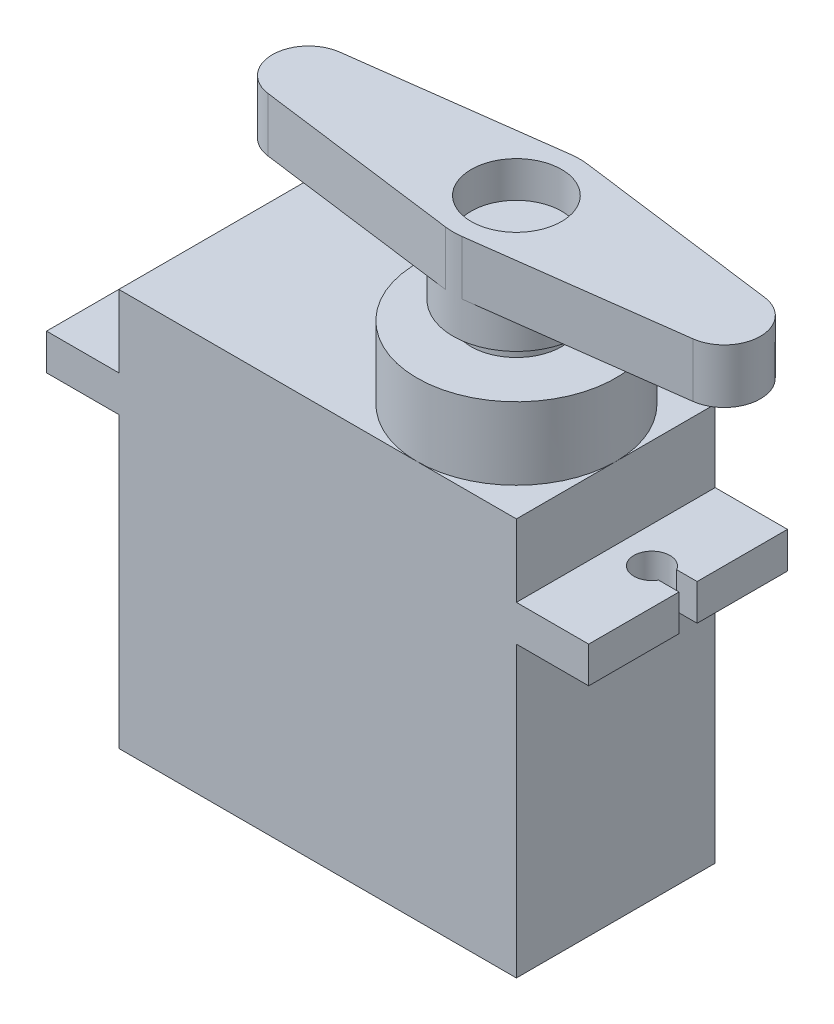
ISO-10303-21;
HEADER;
FILE_DESCRIPTION(('STEP AP214'),'2;1');
FILE_NAME('part.step','',(''),(''),'','','');
FILE_SCHEMA(('AUTOMOTIVE_DESIGN { 1 0 10303 214 1 1 1 1 }'));
ENDSEC;
DATA;
#1=APPLICATION_CONTEXT('core data for automotive mechanical design processes');
#2=APPLICATION_PROTOCOL_DEFINITION('international standard','automotive_design',2000,#1);
#3=PRODUCT_CONTEXT('',#1,'mechanical');
#4=PRODUCT('Part','Part','',(#3));
#5=PRODUCT_RELATED_PRODUCT_CATEGORY('part','',(#4));
#6=PRODUCT_DEFINITION_FORMATION('','',#4);
#7=PRODUCT_DEFINITION_CONTEXT('part definition',#1,'design');
#8=PRODUCT_DEFINITION('design','',#6,#7);
#9=PRODUCT_DEFINITION_SHAPE('','',#8);
#10=(LENGTH_UNIT() NAMED_UNIT(*) SI_UNIT(.MILLI.,.METRE.));
#11=(NAMED_UNIT(*) PLANE_ANGLE_UNIT() SI_UNIT($,.RADIAN.));
#12=(NAMED_UNIT(*) SI_UNIT($,.STERADIAN.) SOLID_ANGLE_UNIT());
#13=UNCERTAINTY_MEASURE_WITH_UNIT(LENGTH_MEASURE(1.E-05),#10,'distance_accuracy_value','');
#14=(GEOMETRIC_REPRESENTATION_CONTEXT(3) GLOBAL_UNCERTAINTY_ASSIGNED_CONTEXT((#13)) GLOBAL_UNIT_ASSIGNED_CONTEXT((#10,
#11,#12)) REPRESENTATION_CONTEXT('',''));
#15=CARTESIAN_POINT('',(0.,0.,0.));
#16=DIRECTION('',(0.,0.,1.));
#17=DIRECTION('',(1.,0.,0.));
#18=AXIS2_PLACEMENT_3D('',#15,#16,#17);
#19=CARTESIAN_POINT('',(5.5,30.,0.));
#20=DIRECTION('',(0.,-1.,0.));
#21=DIRECTION('',(0.,0.,-1.));
#22=AXIS2_PLACEMENT_3D('',#19,#20,#21);
#23=CYLINDRICAL_SURFACE('',#22,2.5);
#24=CARTESIAN_POINT('',(5.5,26.,0.));
#25=DIRECTION('',(0.,1.,0.));
#26=DIRECTION('',(0.,0.,1.));
#27=AXIS2_PLACEMENT_3D('',#24,#25,#26);
#28=CIRCLE('',#27,2.5);
#29=CARTESIAN_POINT('',(5.5,26.,2.5));
#30=VERTEX_POINT('',#29);
#31=EDGE_CURVE('E42',#30,#30,#28,.T.);
#32=ORIENTED_EDGE('',*,*,#31,.T.);
#33=EDGE_LOOP('',(#32));
#34=FACE_BOUND('',#33,.T.);
#35=CARTESIAN_POINT('',(5.5,27.,0.));
#36=DIRECTION('',(0.,1.,0.));
#37=DIRECTION('',(0.,0.,1.));
#38=AXIS2_PLACEMENT_3D('',#35,#36,#37);
#39=CIRCLE('',#38,2.5);
#40=CARTESIAN_POINT('',(5.5,27.,2.5));
#41=VERTEX_POINT('',#40);
#42=EDGE_CURVE('E11',#41,#41,#39,.T.);
#43=ORIENTED_EDGE('',*,*,#42,.F.);
#44=EDGE_LOOP('',(#43));
#45=FACE_BOUND('',#44,.T.);
#46=ADVANCED_FACE('F34',(#34,#45),#23,.T.);
#47=CARTESIAN_POINT('',(0.,22.,0.));
#48=DIRECTION('',(0.,1.,0.));
#49=DIRECTION('',(0.,0.,1.));
#50=AXIS2_PLACEMENT_3D('',#47,#48,#49);
#51=PLANE('',#50);
#52=CARTESIAN_POINT('',(5.5,22.,0.));
#53=DIRECTION('',(0.,1.,0.));
#54=DIRECTION('',(0.,0.,1.));
#55=AXIS2_PLACEMENT_3D('',#52,#53,#54);
#56=CIRCLE('',#55,5.5);
#57=CARTESIAN_POINT('',(5.5,22.,5.5));
#58=VERTEX_POINT('',#57);
#59=CARTESIAN_POINT('',(11.,22.,0.));
#60=VERTEX_POINT('',#59);
#61=EDGE_CURVE('E307',#58,#60,#56,.T.);
#62=ORIENTED_EDGE('',*,*,#61,.F.);
#63=DIRECTION('',(1.,0.,0.));
#64=VECTOR('',#63,1.);
#65=CARTESIAN_POINT('',(-11.,22.,5.5));
#66=LINE('',#65,#64);
#67=CARTESIAN_POINT('',(11.,22.,5.5));
#68=VERTEX_POINT('',#67);
#69=EDGE_CURVE('E437',#58,#68,#66,.T.);
#70=ORIENTED_EDGE('',*,*,#69,.T.);
#71=DIRECTION('',(0.,0.,-1.));
#72=VECTOR('',#71,1.);
#73=CARTESIAN_POINT('',(11.,22.,-5.5));
#74=LINE('',#73,#72);
#75=EDGE_CURVE('E427',#68,#60,#74,.T.);
#76=ORIENTED_EDGE('',*,*,#75,.T.);
#77=EDGE_LOOP('',(#62,#70,#76));
#78=FACE_BOUND('',#77,.T.);
#79=ADVANCED_FACE('F519',(#78),#51,.T.);
#80=CARTESIAN_POINT('',(5.5,22.,-5.5));
#81=VERTEX_POINT('',#80);
#82=EDGE_CURVE('E310',#60,#81,#56,.T.);
#83=ORIENTED_EDGE('',*,*,#82,.F.);
#84=CARTESIAN_POINT('',(11.,22.,-5.5));
#85=VERTEX_POINT('',#84);
#86=EDGE_CURVE('E431',#60,#85,#74,.T.);
#87=ORIENTED_EDGE('',*,*,#86,.T.);
#88=DIRECTION('',(-1.,0.,0.));
#89=VECTOR('',#88,1.);
#90=CARTESIAN_POINT('',(-11.,22.,-5.5));
#91=LINE('',#90,#89);
#92=EDGE_CURVE('E432',#85,#81,#91,.T.);
#93=ORIENTED_EDGE('',*,*,#92,.T.);
#94=EDGE_LOOP('',(#83,#87,#93));
#95=FACE_BOUND('',#94,.T.);
#96=ADVANCED_FACE('F515',(#95),#51,.T.);
#97=CARTESIAN_POINT('',(-15.,18.,5.5));
#98=DIRECTION('',(0.,1.,0.));
#99=DIRECTION('',(0.,0.,1.));
#100=AXIS2_PLACEMENT_3D('',#97,#98,#99);
#101=PLANE('',#100);
#102=CARTESIAN_POINT('',(-13.,18.,0.));
#103=DIRECTION('',(0.,-1.,0.));
#104=DIRECTION('',(0.,0.,1.));
#105=AXIS2_PLACEMENT_3D('',#102,#103,#104);
#106=CIRCLE('',#105,1.);
#107=CARTESIAN_POINT('',(-13.8660254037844,18.,-0.499999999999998));
#108=VERTEX_POINT('',#107);
#109=CARTESIAN_POINT('',(-13.8660254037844,18.,0.499999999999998));
#110=VERTEX_POINT('',#109);
#111=EDGE_CURVE('E328',#108,#110,#106,.T.);
#112=ORIENTED_EDGE('',*,*,#111,.T.);
#113=DIRECTION('',(-1.,0.,0.));
#114=VECTOR('',#113,1.);
#115=CARTESIAN_POINT('',(-15.,18.,0.500000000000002));
#116=LINE('',#115,#114);
#117=CARTESIAN_POINT('',(-15.,18.,0.500000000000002));
#118=VERTEX_POINT('',#117);
#119=EDGE_CURVE('E314',#110,#118,#116,.T.);
#120=ORIENTED_EDGE('',*,*,#119,.T.);
#121=DIRECTION('',(0.,0.,1.));
#122=VECTOR('',#121,1.);
#123=CARTESIAN_POINT('',(-15.,18.,5.5));
#124=LINE('',#123,#122);
#125=CARTESIAN_POINT('',(-15.,18.,5.5));
#126=VERTEX_POINT('',#125);
#127=EDGE_CURVE('E348',#118,#126,#124,.T.);
#128=ORIENTED_EDGE('',*,*,#127,.T.);
#129=DIRECTION('',(1.,0.,0.));
#130=VECTOR('',#129,1.);
#131=CARTESIAN_POINT('',(-15.,18.,5.5));
#132=LINE('',#131,#130);
#133=CARTESIAN_POINT('',(-11.,18.,5.5));
#134=VERTEX_POINT('',#133);
#135=EDGE_CURVE('E370',#126,#134,#132,.T.);
#136=ORIENTED_EDGE('',*,*,#135,.T.);
#137=DIRECTION('',(0.,0.,1.));
#138=VECTOR('',#137,1.);
#139=CARTESIAN_POINT('',(-11.,18.,5.5));
#140=LINE('',#139,#138);
#141=CARTESIAN_POINT('',(-11.,18.,-5.5));
#142=VERTEX_POINT('',#141);
#143=EDGE_CURVE('E325',#142,#134,#140,.T.);
#144=ORIENTED_EDGE('',*,*,#143,.F.);
#145=DIRECTION('',(1.,0.,0.));
#146=VECTOR('',#145,1.);
#147=CARTESIAN_POINT('',(-15.,18.,-5.5));
#148=LINE('',#147,#146);
#149=CARTESIAN_POINT('',(-15.,18.,-5.5));
#150=VERTEX_POINT('',#149);
#151=EDGE_CURVE('E368',#150,#142,#148,.T.);
#152=ORIENTED_EDGE('',*,*,#151,.F.);
#153=CARTESIAN_POINT('',(-15.,18.,-0.500000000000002));
#154=VERTEX_POINT('',#153);
#155=EDGE_CURVE('E350',#150,#154,#124,.T.);
#156=ORIENTED_EDGE('',*,*,#155,.T.);
#157=DIRECTION('',(1.,0.,0.));
#158=VECTOR('',#157,1.);
#159=CARTESIAN_POINT('',(-15.,18.,-0.500000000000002));
#160=LINE('',#159,#158);
#161=EDGE_CURVE('E331',#154,#108,#160,.T.);
#162=ORIENTED_EDGE('',*,*,#161,.T.);
#163=EDGE_LOOP('',(#112,#120,#128,#136,#144,#152,#156,#162));
#164=FACE_BOUND('',#163,.T.);
#165=ADVANCED_FACE('F497',(#164),#101,.T.);
#166=CARTESIAN_POINT('',(-15.,16.,5.5));
#167=DIRECTION('',(0.,-1.,0.));
#168=DIRECTION('',(0.,0.,-1.));
#169=AXIS2_PLACEMENT_3D('',#166,#167,#168);
#170=PLANE('',#169);
#171=DIRECTION('',(0.,0.,-1.));
#172=VECTOR('',#171,1.);
#173=CARTESIAN_POINT('',(-15.,16.,5.5));
#174=LINE('',#173,#172);
#175=CARTESIAN_POINT('',(-15.,16.,5.5));
#176=VERTEX_POINT('',#175);
#177=CARTESIAN_POINT('',(-15.,16.,0.500000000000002));
#178=VERTEX_POINT('',#177);
#179=EDGE_CURVE('E357',#176,#178,#174,.T.);
#180=ORIENTED_EDGE('',*,*,#179,.T.);
#181=DIRECTION('',(1.,0.,0.));
#182=VECTOR('',#181,1.);
#183=CARTESIAN_POINT('',(-15.,16.,0.500000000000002));
#184=LINE('',#183,#182);
#185=CARTESIAN_POINT('',(-13.8660254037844,16.,0.499999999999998));
#186=VERTEX_POINT('',#185);
#187=EDGE_CURVE('E322',#178,#186,#184,.T.);
#188=ORIENTED_EDGE('',*,*,#187,.T.);
#189=CARTESIAN_POINT('',(-13.,16.,0.));
#190=DIRECTION('',(0.,1.,0.));
#191=DIRECTION('',(0.,0.,1.));
#192=AXIS2_PLACEMENT_3D('',#189,#190,#191);
#193=CIRCLE('',#192,1.);
#194=CARTESIAN_POINT('',(-13.8660254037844,16.,-0.499999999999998));
#195=VERTEX_POINT('',#194);
#196=EDGE_CURVE('E318',#186,#195,#193,.T.);
#197=ORIENTED_EDGE('',*,*,#196,.T.);
#198=DIRECTION('',(-1.,0.,0.));
#199=VECTOR('',#198,1.);
#200=CARTESIAN_POINT('',(-15.,16.,-0.500000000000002));
#201=LINE('',#200,#199);
#202=CARTESIAN_POINT('',(-15.,16.,-0.500000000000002));
#203=VERTEX_POINT('',#202);
#204=EDGE_CURVE('E321',#195,#203,#201,.T.);
#205=ORIENTED_EDGE('',*,*,#204,.T.);
#206=CARTESIAN_POINT('',(-15.,16.,-5.5));
#207=VERTEX_POINT('',#206);
#208=EDGE_CURVE('E356',#203,#207,#174,.T.);
#209=ORIENTED_EDGE('',*,*,#208,.T.);
#210=DIRECTION('',(1.,0.,0.));
#211=VECTOR('',#210,1.);
#212=CARTESIAN_POINT('',(-15.,16.,-5.5));
#213=LINE('',#212,#211);
#214=CARTESIAN_POINT('',(-11.,16.,-5.5));
#215=VERTEX_POINT('',#214);
#216=EDGE_CURVE('E366',#207,#215,#213,.T.);
#217=ORIENTED_EDGE('',*,*,#216,.T.);
#218=DIRECTION('',(0.,0.,-1.));
#219=VECTOR('',#218,1.);
#220=CARTESIAN_POINT('',(-11.,16.,5.5));
#221=LINE('',#220,#219);
#222=CARTESIAN_POINT('',(-11.,16.,5.5));
#223=VERTEX_POINT('',#222);
#224=EDGE_CURVE('E349',#223,#215,#221,.T.);
#225=ORIENTED_EDGE('',*,*,#224,.F.);
#226=DIRECTION('',(1.,0.,0.));
#227=VECTOR('',#226,1.);
#228=CARTESIAN_POINT('',(-15.,16.,5.5));
#229=LINE('',#228,#227);
#230=EDGE_CURVE('E360',#176,#223,#229,.T.);
#231=ORIENTED_EDGE('',*,*,#230,.F.);
#232=EDGE_LOOP('',(#180,#188,#197,#205,#209,#217,#225,#231));
#233=FACE_BOUND('',#232,.T.);
#234=ADVANCED_FACE('F591',(#233),#170,.T.);
#235=CARTESIAN_POINT('',(-15.,0.,0.));
#236=DIRECTION('',(-1.,0.,0.));
#237=DIRECTION('',(0.,0.,-1.));
#238=AXIS2_PLACEMENT_3D('',#235,#236,#237);
#239=PLANE('',#238);
#240=ORIENTED_EDGE('',*,*,#127,.F.);
#241=DIRECTION('',(0.,1.,0.));
#242=VECTOR('',#241,1.);
#243=CARTESIAN_POINT('',(-15.,12.394448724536,0.500000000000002));
#244=LINE('',#243,#242);
#245=EDGE_CURVE('E334',#178,#118,#244,.T.);
#246=ORIENTED_EDGE('',*,*,#245,.F.);
#247=ORIENTED_EDGE('',*,*,#179,.F.);
#248=DIRECTION('',(0.,-1.,0.));
#249=VECTOR('',#248,1.);
#250=CARTESIAN_POINT('',(-15.,18.,5.5));
#251=LINE('',#250,#249);
#252=EDGE_CURVE('E345',#126,#176,#251,.T.);
#253=ORIENTED_EDGE('',*,*,#252,.F.);
#254=EDGE_LOOP('',(#240,#246,#247,#253));
#255=FACE_BOUND('',#254,.T.);
#256=ADVANCED_FACE('F588',(#255),#239,.T.);
#257=ORIENTED_EDGE('',*,*,#208,.F.);
#258=DIRECTION('',(0.,1.,0.));
#259=VECTOR('',#258,1.);
#260=CARTESIAN_POINT('',(-15.,12.394448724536,-0.500000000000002));
#261=LINE('',#260,#259);
#262=EDGE_CURVE('E335',#203,#154,#261,.T.);
#263=ORIENTED_EDGE('',*,*,#262,.T.);
#264=ORIENTED_EDGE('',*,*,#155,.F.);
#265=DIRECTION('',(0.,1.,0.));
#266=VECTOR('',#265,1.);
#267=CARTESIAN_POINT('',(-15.,18.,-5.5));
#268=LINE('',#267,#266);
#269=EDGE_CURVE('E353',#207,#150,#268,.T.);
#270=ORIENTED_EDGE('',*,*,#269,.F.);
#271=EDGE_LOOP('',(#257,#263,#264,#270));
#272=FACE_BOUND('',#271,.T.);
#273=ADVANCED_FACE('F495',(#272),#239,.T.);
#274=CARTESIAN_POINT('',(-11.,22.,-5.5));
#275=DIRECTION('',(1.,0.,0.));
#276=DIRECTION('',(0.,0.,-1.));
#277=AXIS2_PLACEMENT_3D('',#274,#275,#276);
#278=PLANE('',#277);
#279=DIRECTION('',(0.,-1.,0.));
#280=VECTOR('',#279,1.);
#281=CARTESIAN_POINT('',(-11.,22.,5.5));
#282=LINE('',#281,#280);
#283=CARTESIAN_POINT('',(-11.,0.,5.5));
#284=VERTEX_POINT('',#283);
#285=EDGE_CURVE('E454',#223,#284,#282,.T.);
#286=ORIENTED_EDGE('',*,*,#285,.F.);
#287=ORIENTED_EDGE('',*,*,#224,.T.);
#288=DIRECTION('',(0.,-1.,0.));
#289=VECTOR('',#288,1.);
#290=CARTESIAN_POINT('',(-11.,22.,-5.5));
#291=LINE('',#290,#289);
#292=CARTESIAN_POINT('',(-11.,0.,-5.5));
#293=VERTEX_POINT('',#292);
#294=EDGE_CURVE('E458',#215,#293,#291,.T.);
#295=ORIENTED_EDGE('',*,*,#294,.T.);
#296=DIRECTION('',(0.,0.,1.));
#297=VECTOR('',#296,1.);
#298=CARTESIAN_POINT('',(-11.,0.,-5.5));
#299=LINE('',#298,#297);
#300=EDGE_CURVE('E446',#293,#284,#299,.T.);
#301=ORIENTED_EDGE('',*,*,#300,.T.);
#302=EDGE_LOOP('',(#286,#287,#295,#301));
#303=FACE_BOUND('',#302,.T.);
#304=ADVANCED_FACE('F488',(#303),#278,.F.);
#305=CARTESIAN_POINT('',(15.,0.,0.));
#306=DIRECTION('',(1.,0.,0.));
#307=DIRECTION('',(0.,0.,-1.));
#308=AXIS2_PLACEMENT_3D('',#305,#306,#307);
#309=PLANE('',#308);
#310=DIRECTION('',(0.,1.,0.));
#311=VECTOR('',#310,1.);
#312=CARTESIAN_POINT('',(15.,12.394448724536,0.500000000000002));
#313=LINE('',#312,#311);
#314=CARTESIAN_POINT('',(15.,16.,0.500000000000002));
#315=VERTEX_POINT('',#314);
#316=CARTESIAN_POINT('',(15.,18.,0.500000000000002));
#317=VERTEX_POINT('',#316);
#318=EDGE_CURVE('E376',#315,#317,#313,.T.);
#319=ORIENTED_EDGE('',*,*,#318,.T.);
#320=DIRECTION('',(0.,0.,1.));
#321=VECTOR('',#320,1.);
#322=CARTESIAN_POINT('',(15.,18.,5.5));
#323=LINE('',#322,#321);
#324=CARTESIAN_POINT('',(15.,18.,5.5));
#325=VERTEX_POINT('',#324);
#326=EDGE_CURVE('E406',#317,#325,#323,.T.);
#327=ORIENTED_EDGE('',*,*,#326,.T.);
#328=DIRECTION('',(0.,-1.,0.));
#329=VECTOR('',#328,1.);
#330=CARTESIAN_POINT('',(15.,18.,5.5));
#331=LINE('',#330,#329);
#332=CARTESIAN_POINT('',(15.,16.,5.5));
#333=VERTEX_POINT('',#332);
#334=EDGE_CURVE('E396',#325,#333,#331,.T.);
#335=ORIENTED_EDGE('',*,*,#334,.T.);
#336=DIRECTION('',(0.,0.,-1.));
#337=VECTOR('',#336,1.);
#338=CARTESIAN_POINT('',(15.,16.,5.5));
#339=LINE('',#338,#337);
#340=EDGE_CURVE('E401',#333,#315,#339,.T.);
#341=ORIENTED_EDGE('',*,*,#340,.T.);
#342=EDGE_LOOP('',(#319,#327,#335,#341));
#343=FACE_BOUND('',#342,.T.);
#344=ADVANCED_FACE('F538',(#343),#309,.T.);
#345=CARTESIAN_POINT('',(11.,22.,-5.5));
#346=DIRECTION('',(-1.,0.,0.));
#347=DIRECTION('',(0.,0.,1.));
#348=AXIS2_PLACEMENT_3D('',#345,#346,#347);
#349=PLANE('',#348);
#350=DIRECTION('',(0.,0.,1.));
#351=VECTOR('',#350,1.);
#352=CARTESIAN_POINT('',(11.,18.,5.5));
#353=LINE('',#352,#351);
#354=CARTESIAN_POINT('',(11.,18.,-5.5));
#355=VERTEX_POINT('',#354);
#356=CARTESIAN_POINT('',(11.,18.,5.5));
#357=VERTEX_POINT('',#356);
#358=EDGE_CURVE('E400',#355,#357,#353,.T.);
#359=ORIENTED_EDGE('',*,*,#358,.F.);
#360=DIRECTION('',(0.,-1.,0.));
#361=VECTOR('',#360,1.);
#362=CARTESIAN_POINT('',(11.,22.,-5.5));
#363=LINE('',#362,#361);
#364=EDGE_CURVE('E462',#85,#355,#363,.T.);
#365=ORIENTED_EDGE('',*,*,#364,.F.);
#366=ORIENTED_EDGE('',*,*,#86,.F.);
#367=ORIENTED_EDGE('',*,*,#75,.F.);
#368=DIRECTION('',(0.,-1.,0.));
#369=VECTOR('',#368,1.);
#370=CARTESIAN_POINT('',(11.,22.,5.5));
#371=LINE('',#370,#369);
#372=EDGE_CURVE('E452',#68,#357,#371,.T.);
#373=ORIENTED_EDGE('',*,*,#372,.T.);
#374=EDGE_LOOP('',(#359,#365,#366,#367,#373));
#375=FACE_BOUND('',#374,.T.);
#376=ADVANCED_FACE('F36',(#375),#349,.F.);
#377=DIRECTION('',(0.,0.,-1.));
#378=VECTOR('',#377,1.);
#379=CARTESIAN_POINT('',(11.,16.,5.5));
#380=LINE('',#379,#378);
#381=CARTESIAN_POINT('',(11.,16.,5.5));
#382=VERTEX_POINT('',#381);
#383=CARTESIAN_POINT('',(11.,16.,-5.5));
#384=VERTEX_POINT('',#383);
#385=EDGE_CURVE('E395',#382,#384,#380,.T.);
#386=ORIENTED_EDGE('',*,*,#385,.F.);
#387=CARTESIAN_POINT('',(11.,0.,5.5));
#388=VERTEX_POINT('',#387);
#389=EDGE_CURVE('E440',#382,#388,#371,.T.);
#390=ORIENTED_EDGE('',*,*,#389,.T.);
#391=DIRECTION('',(0.,0.,-1.));
#392=VECTOR('',#391,1.);
#393=CARTESIAN_POINT('',(11.,0.,-5.5));
#394=LINE('',#393,#392);
#395=CARTESIAN_POINT('',(11.,0.,-5.5));
#396=VERTEX_POINT('',#395);
#397=EDGE_CURVE('E426',#388,#396,#394,.T.);
#398=ORIENTED_EDGE('',*,*,#397,.T.);
#399=EDGE_CURVE('E461',#384,#396,#363,.T.);
#400=ORIENTED_EDGE('',*,*,#399,.F.);
#401=EDGE_LOOP('',(#386,#390,#398,#400));
#402=FACE_BOUND('',#401,.T.);
#403=ADVANCED_FACE('F480',(#402),#349,.F.);
#404=CARTESIAN_POINT('',(-11.,22.,-5.5));
#405=DIRECTION('',(0.,0.,1.));
#406=DIRECTION('',(1.,0.,0.));
#407=AXIS2_PLACEMENT_3D('',#404,#405,#406);
#408=PLANE('',#407);
#409=DIRECTION('',(-1.,0.,0.));
#410=VECTOR('',#409,1.);
#411=CARTESIAN_POINT('',(-11.,0.,-5.5));
#412=LINE('',#411,#410);
#413=EDGE_CURVE('E443',#396,#293,#412,.T.);
#414=ORIENTED_EDGE('',*,*,#413,.T.);
#415=ORIENTED_EDGE('',*,*,#294,.F.);
#416=ORIENTED_EDGE('',*,*,#216,.F.);
#417=ORIENTED_EDGE('',*,*,#269,.T.);
#418=ORIENTED_EDGE('',*,*,#151,.T.);
#419=CARTESIAN_POINT('',(-11.,22.,-5.5));
#420=VERTEX_POINT('',#419);
#421=EDGE_CURVE('E459',#420,#142,#291,.T.);
#422=ORIENTED_EDGE('',*,*,#421,.F.);
#423=EDGE_CURVE('E430',#81,#420,#91,.T.);
#424=ORIENTED_EDGE('',*,*,#423,.F.);
#425=ORIENTED_EDGE('',*,*,#92,.F.);
#426=ORIENTED_EDGE('',*,*,#364,.T.);
#427=DIRECTION('',(-1.,0.,0.));
#428=VECTOR('',#427,1.);
#429=CARTESIAN_POINT('',(15.,18.,-5.5));
#430=LINE('',#429,#428);
#431=CARTESIAN_POINT('',(15.,18.,-5.5));
#432=VERTEX_POINT('',#431);
#433=EDGE_CURVE('E417',#432,#355,#430,.T.);
#434=ORIENTED_EDGE('',*,*,#433,.F.);
#435=DIRECTION('',(0.,1.,0.));
#436=VECTOR('',#435,1.);
#437=CARTESIAN_POINT('',(15.,18.,-5.5));
#438=LINE('',#437,#436);
#439=CARTESIAN_POINT('',(15.,16.,-5.5));
#440=VERTEX_POINT('',#439);
#441=EDGE_CURVE('E404',#440,#432,#438,.T.);
#442=ORIENTED_EDGE('',*,*,#441,.F.);
#443=DIRECTION('',(-1.,0.,0.));
#444=VECTOR('',#443,1.);
#445=CARTESIAN_POINT('',(15.,16.,-5.5));
#446=LINE('',#445,#444);
#447=EDGE_CURVE('E420',#440,#384,#446,.T.);
#448=ORIENTED_EDGE('',*,*,#447,.T.);
#449=ORIENTED_EDGE('',*,*,#399,.T.);
#450=EDGE_LOOP('',(#414,#415,#416,#417,#418,#422,#424,#425,#426,#434,#442,#448,#449));
#451=FACE_BOUND('',#450,.T.);
#452=ADVANCED_FACE('F470',(#451),#408,.F.);
#453=ORIENTED_EDGE('',*,*,#421,.T.);
#454=ORIENTED_EDGE('',*,*,#143,.T.);
#455=CARTESIAN_POINT('',(-11.,22.,5.5));
#456=VERTEX_POINT('',#455);
#457=EDGE_CURVE('E455',#456,#134,#282,.T.);
#458=ORIENTED_EDGE('',*,*,#457,.F.);
#459=DIRECTION('',(0.,0.,1.));
#460=VECTOR('',#459,1.);
#461=CARTESIAN_POINT('',(-11.,22.,-5.5));
#462=LINE('',#461,#460);
#463=EDGE_CURVE('E435',#420,#456,#462,.T.);
#464=ORIENTED_EDGE('',*,*,#463,.F.);
#465=EDGE_LOOP('',(#453,#454,#458,#464));
#466=FACE_BOUND('',#465,.T.);
#467=ADVANCED_FACE('F504',(#466),#278,.F.);
#468=CARTESIAN_POINT('',(-11.,22.,5.5));
#469=DIRECTION('',(0.,0.,-1.));
#470=DIRECTION('',(-1.,0.,0.));
#471=AXIS2_PLACEMENT_3D('',#468,#469,#470);
#472=PLANE('',#471);
#473=DIRECTION('',(1.,0.,0.));
#474=VECTOR('',#473,1.);
#475=CARTESIAN_POINT('',(-11.,0.,5.5));
#476=LINE('',#475,#474);
#477=EDGE_CURVE('E449',#284,#388,#476,.T.);
#478=ORIENTED_EDGE('',*,*,#477,.T.);
#479=ORIENTED_EDGE('',*,*,#389,.F.);
#480=DIRECTION('',(-1.,0.,0.));
#481=VECTOR('',#480,1.);
#482=CARTESIAN_POINT('',(15.,16.,5.5));
#483=LINE('',#482,#481);
#484=EDGE_CURVE('E423',#333,#382,#483,.T.);
#485=ORIENTED_EDGE('',*,*,#484,.F.);
#486=ORIENTED_EDGE('',*,*,#334,.F.);
#487=DIRECTION('',(-1.,0.,0.));
#488=VECTOR('',#487,1.);
#489=CARTESIAN_POINT('',(15.,18.,5.5));
#490=LINE('',#489,#488);
#491=EDGE_CURVE('E410',#325,#357,#490,.T.);
#492=ORIENTED_EDGE('',*,*,#491,.T.);
#493=ORIENTED_EDGE('',*,*,#372,.F.);
#494=ORIENTED_EDGE('',*,*,#69,.F.);
#495=EDGE_CURVE('E438',#456,#58,#66,.T.);
#496=ORIENTED_EDGE('',*,*,#495,.F.);
#497=ORIENTED_EDGE('',*,*,#457,.T.);
#498=ORIENTED_EDGE('',*,*,#135,.F.);
#499=ORIENTED_EDGE('',*,*,#252,.T.);
#500=ORIENTED_EDGE('',*,*,#230,.T.);
#501=ORIENTED_EDGE('',*,*,#285,.T.);
#502=EDGE_LOOP('',(#478,#479,#485,#486,#492,#493,#494,#496,#497,#498,#499,#500,#501));
#503=FACE_BOUND('',#502,.T.);
#504=ADVANCED_FACE('F484',(#503),#472,.F.);
#505=EDGE_CURVE('E317',#81,#58,#56,.T.);
#506=ORIENTED_EDGE('',*,*,#505,.F.);
#507=ORIENTED_EDGE('',*,*,#423,.T.);
#508=ORIENTED_EDGE('',*,*,#463,.T.);
#509=ORIENTED_EDGE('',*,*,#495,.T.);
#510=EDGE_LOOP('',(#506,#507,#508,#509));
#511=FACE_BOUND('',#510,.T.);
#512=ADVANCED_FACE('F507',(#511),#51,.T.);
#513=CARTESIAN_POINT('',(0.,0.,0.));
#514=DIRECTION('',(0.,1.,0.));
#515=DIRECTION('',(0.,0.,1.));
#516=AXIS2_PLACEMENT_3D('',#513,#514,#515);
#517=PLANE('',#516);
#518=ORIENTED_EDGE('',*,*,#397,.F.);
#519=ORIENTED_EDGE('',*,*,#477,.F.);
#520=ORIENTED_EDGE('',*,*,#300,.F.);
#521=ORIENTED_EDGE('',*,*,#413,.F.);
#522=EDGE_LOOP('',(#518,#519,#520,#521));
#523=FACE_BOUND('',#522,.T.);
#524=ADVANCED_FACE('F478',(#523),#517,.F.);
#525=CARTESIAN_POINT('',(15.,16.,5.5));
#526=DIRECTION('',(0.,1.,0.));
#527=DIRECTION('',(0.,0.,1.));
#528=AXIS2_PLACEMENT_3D('',#525,#526,#527);
#529=PLANE('',#528);
#530=CARTESIAN_POINT('',(13.,16.,0.));
#531=DIRECTION('',(0.,1.,0.));
#532=DIRECTION('',(0.,0.,1.));
#533=AXIS2_PLACEMENT_3D('',#530,#531,#532);
#534=CIRCLE('',#533,1.);
#535=CARTESIAN_POINT('',(13.8660254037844,16.,0.499999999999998));
#536=VERTEX_POINT('',#535);
#537=CARTESIAN_POINT('',(13.8660254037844,16.,-0.499999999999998));
#538=VERTEX_POINT('',#537);
#539=EDGE_CURVE('E373',#536,#538,#534,.F.);
#540=ORIENTED_EDGE('',*,*,#539,.F.);
#541=DIRECTION('',(-1.,0.,0.));
#542=VECTOR('',#541,1.);
#543=CARTESIAN_POINT('',(15.,16.,0.500000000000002));
#544=LINE('',#543,#542);
#545=EDGE_CURVE('E375',#315,#536,#544,.T.);
#546=ORIENTED_EDGE('',*,*,#545,.F.);
#547=ORIENTED_EDGE('',*,*,#340,.F.);
#548=ORIENTED_EDGE('',*,*,#484,.T.);
#549=ORIENTED_EDGE('',*,*,#385,.T.);
#550=ORIENTED_EDGE('',*,*,#447,.F.);
#551=CARTESIAN_POINT('',(15.,16.,-0.500000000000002));
#552=VERTEX_POINT('',#551);
#553=EDGE_CURVE('E399',#552,#440,#339,.T.);
#554=ORIENTED_EDGE('',*,*,#553,.F.);
#555=DIRECTION('',(1.,0.,0.));
#556=VECTOR('',#555,1.);
#557=CARTESIAN_POINT('',(15.,16.,-0.500000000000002));
#558=LINE('',#557,#556);
#559=EDGE_CURVE('E378',#538,#552,#558,.T.);
#560=ORIENTED_EDGE('',*,*,#559,.F.);
#561=EDGE_LOOP('',(#540,#546,#547,#548,#549,#550,#554,#560));
#562=FACE_BOUND('',#561,.T.);
#563=ADVANCED_FACE('F535',(#562),#529,.F.);
#564=CARTESIAN_POINT('',(15.,18.,5.5));
#565=DIRECTION('',(0.,-1.,0.));
#566=DIRECTION('',(0.,0.,-1.));
#567=AXIS2_PLACEMENT_3D('',#564,#565,#566);
#568=PLANE('',#567);
#569=ORIENTED_EDGE('',*,*,#326,.F.);
#570=DIRECTION('',(1.,0.,0.));
#571=VECTOR('',#570,1.);
#572=CARTESIAN_POINT('',(15.,18.,0.500000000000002));
#573=LINE('',#572,#571);
#574=CARTESIAN_POINT('',(13.8660254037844,18.,0.499999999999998));
#575=VERTEX_POINT('',#574);
#576=EDGE_CURVE('E384',#575,#317,#573,.T.);
#577=ORIENTED_EDGE('',*,*,#576,.F.);
#578=CARTESIAN_POINT('',(13.,18.,0.));
#579=DIRECTION('',(0.,1.,0.));
#580=DIRECTION('',(0.,0.,1.));
#581=AXIS2_PLACEMENT_3D('',#578,#579,#580);
#582=CIRCLE('',#581,1.);
#583=CARTESIAN_POINT('',(13.8660254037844,18.,-0.499999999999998));
#584=VERTEX_POINT('',#583);
#585=EDGE_CURVE('E381',#584,#575,#582,.T.);
#586=ORIENTED_EDGE('',*,*,#585,.F.);
#587=DIRECTION('',(-1.,0.,0.));
#588=VECTOR('',#587,1.);
#589=CARTESIAN_POINT('',(15.,18.,-0.500000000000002));
#590=LINE('',#589,#588);
#591=CARTESIAN_POINT('',(15.,18.,-0.500000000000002));
#592=VERTEX_POINT('',#591);
#593=EDGE_CURVE('E372',#592,#584,#590,.T.);
#594=ORIENTED_EDGE('',*,*,#593,.F.);
#595=EDGE_CURVE('E407',#432,#592,#323,.T.);
#596=ORIENTED_EDGE('',*,*,#595,.F.);
#597=ORIENTED_EDGE('',*,*,#433,.T.);
#598=ORIENTED_EDGE('',*,*,#358,.T.);
#599=ORIENTED_EDGE('',*,*,#491,.F.);
#600=EDGE_LOOP('',(#569,#577,#586,#594,#596,#597,#598,#599));
#601=FACE_BOUND('',#600,.T.);
#602=ADVANCED_FACE('F525',(#601),#568,.F.);
#603=DIRECTION('',(0.,1.,0.));
#604=VECTOR('',#603,1.);
#605=CARTESIAN_POINT('',(15.,12.394448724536,-0.500000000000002));
#606=LINE('',#605,#604);
#607=EDGE_CURVE('E386',#552,#592,#606,.T.);
#608=ORIENTED_EDGE('',*,*,#607,.F.);
#609=ORIENTED_EDGE('',*,*,#553,.T.);
#610=ORIENTED_EDGE('',*,*,#441,.T.);
#611=ORIENTED_EDGE('',*,*,#595,.T.);
#612=EDGE_LOOP('',(#608,#609,#610,#611));
#613=FACE_BOUND('',#612,.T.);
#614=ADVANCED_FACE('F530',(#613),#309,.T.);
#615=CARTESIAN_POINT('',(15.,12.394448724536,0.500000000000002));
#616=DIRECTION('',(0.,0.,1.));
#617=DIRECTION('',(1.,0.,0.));
#618=AXIS2_PLACEMENT_3D('',#615,#616,#617);
#619=PLANE('',#618);
#620=ORIENTED_EDGE('',*,*,#545,.T.);
#621=DIRECTION('',(0.,1.,0.));
#622=VECTOR('',#621,1.);
#623=CARTESIAN_POINT('',(13.8660254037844,12.394448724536,0.499999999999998));
#624=LINE('',#623,#622);
#625=EDGE_CURVE('E389',#536,#575,#624,.T.);
#626=ORIENTED_EDGE('',*,*,#625,.T.);
#627=ORIENTED_EDGE('',*,*,#576,.T.);
#628=ORIENTED_EDGE('',*,*,#318,.F.);
#629=EDGE_LOOP('',(#620,#626,#627,#628));
#630=FACE_BOUND('',#629,.T.);
#631=ADVANCED_FACE('F542',(#630),#619,.F.);
#632=CARTESIAN_POINT('',(13.,12.394448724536,0.));
#633=DIRECTION('',(0.,1.,0.));
#634=DIRECTION('',(0.,0.,1.));
#635=AXIS2_PLACEMENT_3D('',#632,#633,#634);
#636=CYLINDRICAL_SURFACE('',#635,1.);
#637=ORIENTED_EDGE('',*,*,#539,.T.);
#638=DIRECTION('',(0.,1.,0.));
#639=VECTOR('',#638,1.);
#640=CARTESIAN_POINT('',(13.8660254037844,12.394448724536,-0.499999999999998));
#641=LINE('',#640,#639);
#642=EDGE_CURVE('E391',#538,#584,#641,.T.);
#643=ORIENTED_EDGE('',*,*,#642,.T.);
#644=ORIENTED_EDGE('',*,*,#585,.T.);
#645=ORIENTED_EDGE('',*,*,#625,.F.);
#646=EDGE_LOOP('',(#637,#643,#644,#645));
#647=FACE_BOUND('',#646,.T.);
#648=ADVANCED_FACE('F545',(#647),#636,.F.);
#649=CARTESIAN_POINT('',(15.,12.394448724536,-0.500000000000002));
#650=DIRECTION('',(0.,0.,-1.));
#651=DIRECTION('',(-1.,0.,0.));
#652=AXIS2_PLACEMENT_3D('',#649,#650,#651);
#653=PLANE('',#652);
#654=ORIENTED_EDGE('',*,*,#559,.T.);
#655=ORIENTED_EDGE('',*,*,#607,.T.);
#656=ORIENTED_EDGE('',*,*,#593,.T.);
#657=ORIENTED_EDGE('',*,*,#642,.F.);
#658=EDGE_LOOP('',(#654,#655,#656,#657));
#659=FACE_BOUND('',#658,.T.);
#660=ADVANCED_FACE('F548',(#659),#653,.F.);
#661=CARTESIAN_POINT('',(-15.,12.394448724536,0.500000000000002));
#662=DIRECTION('',(0.,0.,-1.));
#663=DIRECTION('',(-1.,0.,0.));
#664=AXIS2_PLACEMENT_3D('',#661,#662,#663);
#665=PLANE('',#664);
#666=ORIENTED_EDGE('',*,*,#245,.T.);
#667=ORIENTED_EDGE('',*,*,#119,.F.);
#668=DIRECTION('',(0.,1.,0.));
#669=VECTOR('',#668,1.);
#670=CARTESIAN_POINT('',(-13.8660254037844,12.394448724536,0.499999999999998));
#671=LINE('',#670,#669);
#672=EDGE_CURVE('E340',#186,#110,#671,.T.);
#673=ORIENTED_EDGE('',*,*,#672,.F.);
#674=ORIENTED_EDGE('',*,*,#187,.F.);
#675=EDGE_LOOP('',(#666,#667,#673,#674));
#676=FACE_BOUND('',#675,.T.);
#677=ADVANCED_FACE('F550',(#676),#665,.T.);
#678=CARTESIAN_POINT('',(-13.,12.394448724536,0.));
#679=DIRECTION('',(0.,1.,0.));
#680=DIRECTION('',(0.,0.,1.));
#681=AXIS2_PLACEMENT_3D('',#678,#679,#680);
#682=CYLINDRICAL_SURFACE('',#681,1.);
#683=ORIENTED_EDGE('',*,*,#672,.T.);
#684=ORIENTED_EDGE('',*,*,#111,.F.);
#685=DIRECTION('',(0.,1.,0.));
#686=VECTOR('',#685,1.);
#687=CARTESIAN_POINT('',(-13.8660254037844,12.394448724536,-0.499999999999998));
#688=LINE('',#687,#686);
#689=EDGE_CURVE('E338',#195,#108,#688,.T.);
#690=ORIENTED_EDGE('',*,*,#689,.F.);
#691=ORIENTED_EDGE('',*,*,#196,.F.);
#692=EDGE_LOOP('',(#683,#684,#690,#691));
#693=FACE_BOUND('',#692,.T.);
#694=ADVANCED_FACE('F556',(#693),#682,.F.);
#695=CARTESIAN_POINT('',(-15.,12.394448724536,-0.500000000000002));
#696=DIRECTION('',(0.,0.,1.));
#697=DIRECTION('',(1.,0.,0.));
#698=AXIS2_PLACEMENT_3D('',#695,#696,#697);
#699=PLANE('',#698);
#700=ORIENTED_EDGE('',*,*,#689,.T.);
#701=ORIENTED_EDGE('',*,*,#161,.F.);
#702=ORIENTED_EDGE('',*,*,#262,.F.);
#703=ORIENTED_EDGE('',*,*,#204,.F.);
#704=EDGE_LOOP('',(#700,#701,#702,#703));
#705=FACE_BOUND('',#704,.T.);
#706=ADVANCED_FACE('F580',(#705),#699,.T.);
#707=CARTESIAN_POINT('',(5.5,26.,0.));
#708=DIRECTION('',(0.,-1.,0.));
#709=DIRECTION('',(0.,0.,-1.));
#710=AXIS2_PLACEMENT_3D('',#707,#708,#709);
#711=CYLINDRICAL_SURFACE('',#710,5.5);
#712=CARTESIAN_POINT('',(5.5,26.,0.));
#713=DIRECTION('',(0.,1.,0.));
#714=DIRECTION('',(0.,0.,1.));
#715=AXIS2_PLACEMENT_3D('',#712,#713,#714);
#716=CIRCLE('',#715,5.5);
#717=CARTESIAN_POINT('',(5.5,26.,5.5));
#718=VERTEX_POINT('',#717);
#719=EDGE_CURVE('E311',#718,#718,#716,.T.);
#720=ORIENTED_EDGE('',*,*,#719,.F.);
#721=EDGE_LOOP('',(#720));
#722=FACE_BOUND('',#721,.T.);
#723=ORIENTED_EDGE('',*,*,#61,.T.);
#724=ORIENTED_EDGE('',*,*,#82,.T.);
#725=ORIENTED_EDGE('',*,*,#505,.T.);
#726=EDGE_LOOP('',(#723,#724,#725));
#727=FACE_BOUND('',#726,.T.);
#728=ADVANCED_FACE('F511',(#722,#727),#711,.T.);
#729=CARTESIAN_POINT('',(5.5,26.,0.));
#730=DIRECTION('',(0.,1.,0.));
#731=DIRECTION('',(0.,0.,1.));
#732=AXIS2_PLACEMENT_3D('',#729,#730,#731);
#733=PLANE('',#732);
#734=ORIENTED_EDGE('',*,*,#31,.F.);
#735=EDGE_LOOP('',(#734));
#736=FACE_BOUND('',#735,.T.);
#737=ORIENTED_EDGE('',*,*,#719,.T.);
#738=EDGE_LOOP('',(#737));
#739=FACE_BOUND('',#738,.T.);
#740=ADVANCED_FACE('F573',(#736,#739),#733,.T.);
#741=CARTESIAN_POINT('',(5.5,32.,0.));
#742=DIRECTION('',(0.,1.,0.));
#743=DIRECTION('',(0.,0.,1.));
#744=AXIS2_PLACEMENT_3D('',#741,#742,#743);
#745=PLANE('',#744);
#746=CARTESIAN_POINT('',(5.5,32.,0.));
#747=DIRECTION('',(0.,1.,0.));
#748=DIRECTION('',(0.,0.,1.));
#749=AXIS2_PLACEMENT_3D('',#746,#747,#748);
#750=CIRCLE('',#749,3.5);
#751=CARTESIAN_POINT('',(5.95652173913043,32.,-3.47009911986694));
#752=VERTEX_POINT('',#751);
#753=CARTESIAN_POINT('',(5.04347826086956,32.,-3.47009911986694));
#754=VERTEX_POINT('',#753);
#755=EDGE_CURVE('E302',#752,#754,#750,.T.);
#756=ORIENTED_EDGE('',*,*,#755,.T.);
#757=DIRECTION('',(-0.991456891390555,0.,0.130434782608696));
#758=VECTOR('',#757,1.);
#759=CARTESIAN_POINT('',(5.04347826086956,32.,-3.47009911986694));
#760=LINE('',#759,#758);
#761=CARTESIAN_POINT('',(-6.26086956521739,32.,-1.98291378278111));
#762=VERTEX_POINT('',#761);
#763=EDGE_CURVE('E235',#754,#762,#760,.T.);
#764=ORIENTED_EDGE('',*,*,#763,.T.);
#765=CARTESIAN_POINT('',(-6.,32.,0.));
#766=DIRECTION('',(0.,1.,0.));
#767=DIRECTION('',(0.,0.,-1.));
#768=AXIS2_PLACEMENT_3D('',#765,#766,#767);
#769=CIRCLE('',#768,2.);
#770=CARTESIAN_POINT('',(-6.26086956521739,32.,1.98291378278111));
#771=VERTEX_POINT('',#770);
#772=EDGE_CURVE('E257',#762,#771,#769,.T.);
#773=ORIENTED_EDGE('',*,*,#772,.T.);
#774=DIRECTION('',(0.991456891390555,0.,0.130434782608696));
#775=VECTOR('',#774,1.);
#776=CARTESIAN_POINT('',(5.04347826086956,32.,3.47009911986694));
#777=LINE('',#776,#775);
#778=CARTESIAN_POINT('',(5.04347826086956,32.,3.47009911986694));
#779=VERTEX_POINT('',#778);
#780=EDGE_CURVE('E49',#771,#779,#777,.T.);
#781=ORIENTED_EDGE('',*,*,#780,.T.);
#782=CARTESIAN_POINT('',(5.95652173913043,32.,3.47009911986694));
#783=VERTEX_POINT('',#782);
#784=EDGE_CURVE('E301',#779,#783,#750,.T.);
#785=ORIENTED_EDGE('',*,*,#784,.T.);
#786=DIRECTION('',(0.991456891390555,0.,-0.130434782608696));
#787=VECTOR('',#786,1.);
#788=CARTESIAN_POINT('',(5.95652173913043,32.,3.47009911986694));
#789=LINE('',#788,#787);
#790=CARTESIAN_POINT('',(17.2608695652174,32.,1.98291378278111));
#791=VERTEX_POINT('',#790);
#792=EDGE_CURVE('E265',#783,#791,#789,.T.);
#793=ORIENTED_EDGE('',*,*,#792,.T.);
#794=CARTESIAN_POINT('',(17.,32.,0.));
#795=DIRECTION('',(0.,1.,0.));
#796=DIRECTION('',(0.,0.,1.));
#797=AXIS2_PLACEMENT_3D('',#794,#795,#796);
#798=CIRCLE('',#797,2.);
#799=CARTESIAN_POINT('',(17.2608695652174,32.,-1.98291378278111));
#800=VERTEX_POINT('',#799);
#801=EDGE_CURVE('E284',#791,#800,#798,.T.);
#802=ORIENTED_EDGE('',*,*,#801,.T.);
#803=DIRECTION('',(-0.991456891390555,0.,-0.130434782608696));
#804=VECTOR('',#803,1.);
#805=CARTESIAN_POINT('',(5.95652173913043,32.,-3.47009911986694));
#806=LINE('',#805,#804);
#807=EDGE_CURVE('E56',#800,#752,#806,.T.);
#808=ORIENTED_EDGE('',*,*,#807,.T.);
#809=EDGE_LOOP('',(#756,#764,#773,#781,#785,#793,#802,#808));
#810=FACE_BOUND('',#809,.T.);
#811=CARTESIAN_POINT('',(5.5,32.,0.));
#812=DIRECTION('',(0.,1.,0.));
#813=DIRECTION('',(0.,0.,1.));
#814=AXIS2_PLACEMENT_3D('',#811,#812,#813);
#815=CIRCLE('',#814,2.5);
#816=CARTESIAN_POINT('',(5.5,32.,2.5));
#817=VERTEX_POINT('',#816);
#818=EDGE_CURVE('E298',#817,#817,#815,.T.);
#819=ORIENTED_EDGE('',*,*,#818,.F.);
#820=EDGE_LOOP('',(#819));
#821=FACE_BOUND('',#820,.T.);
#822=ADVANCED_FACE('F576',(#810,#821),#745,.T.);
#823=CARTESIAN_POINT('',(5.5,32.,0.));
#824=DIRECTION('',(0.,-1.,0.));
#825=DIRECTION('',(0.,0.,-1.));
#826=AXIS2_PLACEMENT_3D('',#823,#824,#825);
#827=CYLINDRICAL_SURFACE('',#826,3.5);
#828=ORIENTED_EDGE('',*,*,#784,.F.);
#829=DIRECTION('',(0.,1.,0.));
#830=VECTOR('',#829,1.);
#831=CARTESIAN_POINT('',(5.04347826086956,29.,3.47009911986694));
#832=LINE('',#831,#830);
#833=CARTESIAN_POINT('',(5.04347826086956,29.,3.47009911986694));
#834=VERTEX_POINT('',#833);
#835=EDGE_CURVE('E255',#834,#779,#832,.T.);
#836=ORIENTED_EDGE('',*,*,#835,.F.);
#837=CARTESIAN_POINT('',(5.5,29.,0.));
#838=DIRECTION('',(0.,-1.,0.));
#839=DIRECTION('',(0.,0.,-1.));
#840=AXIS2_PLACEMENT_3D('',#837,#838,#839);
#841=CIRCLE('',#840,3.5);
#842=CARTESIAN_POINT('',(5.04347826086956,29.,-3.47009911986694));
#843=VERTEX_POINT('',#842);
#844=EDGE_CURVE('E246',#834,#843,#841,.T.);
#845=ORIENTED_EDGE('',*,*,#844,.T.);
#846=DIRECTION('',(0.,1.,0.));
#847=VECTOR('',#846,1.);
#848=CARTESIAN_POINT('',(5.04347826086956,29.,-3.47009911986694));
#849=LINE('',#848,#847);
#850=EDGE_CURVE('E230',#843,#754,#849,.T.);
#851=ORIENTED_EDGE('',*,*,#850,.T.);
#852=ORIENTED_EDGE('',*,*,#755,.F.);
#853=DIRECTION('',(0.,1.,0.));
#854=VECTOR('',#853,1.);
#855=CARTESIAN_POINT('',(5.95652173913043,29.,-3.47009911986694));
#856=LINE('',#855,#854);
#857=CARTESIAN_POINT('',(5.95652173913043,29.,-3.47009911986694));
#858=VERTEX_POINT('',#857);
#859=EDGE_CURVE('E287',#858,#752,#856,.T.);
#860=ORIENTED_EDGE('',*,*,#859,.F.);
#861=CARTESIAN_POINT('',(5.5,29.,0.));
#862=DIRECTION('',(0.,-1.,0.));
#863=DIRECTION('',(0.,0.,1.));
#864=AXIS2_PLACEMENT_3D('',#861,#862,#863);
#865=CIRCLE('',#864,3.5);
#866=CARTESIAN_POINT('',(5.95652173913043,29.,3.47009911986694));
#867=VERTEX_POINT('',#866);
#868=EDGE_CURVE('E269',#858,#867,#865,.T.);
#869=ORIENTED_EDGE('',*,*,#868,.T.);
#870=DIRECTION('',(0.,1.,0.));
#871=VECTOR('',#870,1.);
#872=CARTESIAN_POINT('',(5.95652173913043,29.,3.47009911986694));
#873=LINE('',#872,#871);
#874=EDGE_CURVE('E281',#867,#783,#873,.T.);
#875=ORIENTED_EDGE('',*,*,#874,.T.);
#876=EDGE_LOOP('',(#828,#836,#845,#851,#852,#860,#869,#875));
#877=FACE_BOUND('',#876,.T.);
#878=CARTESIAN_POINT('',(5.5,27.,0.));
#879=DIRECTION('',(0.,1.,0.));
#880=DIRECTION('',(0.,0.,1.));
#881=AXIS2_PLACEMENT_3D('',#878,#879,#880);
#882=CIRCLE('',#881,3.5);
#883=CARTESIAN_POINT('',(5.5,27.,3.5));
#884=VERTEX_POINT('',#883);
#885=EDGE_CURVE('E289',#884,#884,#882,.T.);
#886=ORIENTED_EDGE('',*,*,#885,.T.);
#887=EDGE_LOOP('',(#886));
#888=FACE_BOUND('',#887,.T.);
#889=ADVANCED_FACE('F253',(#877,#888),#827,.T.);
#890=CARTESIAN_POINT('',(5.5,32.,0.));
#891=DIRECTION('',(0.,-1.,0.));
#892=DIRECTION('',(0.,0.,-1.));
#893=AXIS2_PLACEMENT_3D('',#890,#891,#892);
#894=CYLINDRICAL_SURFACE('',#893,2.5);
#895=CARTESIAN_POINT('',(5.5,30.,0.));
#896=DIRECTION('',(0.,1.,0.));
#897=DIRECTION('',(0.,0.,1.));
#898=AXIS2_PLACEMENT_3D('',#895,#896,#897);
#899=CIRCLE('',#898,2.5);
#900=CARTESIAN_POINT('',(5.5,30.,2.5));
#901=VERTEX_POINT('',#900);
#902=EDGE_CURVE('E304',#901,#901,#899,.F.);
#903=ORIENTED_EDGE('',*,*,#902,.T.);
#904=EDGE_LOOP('',(#903));
#905=FACE_BOUND('',#904,.T.);
#906=ORIENTED_EDGE('',*,*,#818,.T.);
#907=EDGE_LOOP('',(#906));
#908=FACE_BOUND('',#907,.T.);
#909=ADVANCED_FACE('F695',(#905,#908),#894,.F.);
#910=CARTESIAN_POINT('',(5.5,27.,0.));
#911=DIRECTION('',(0.,1.,0.));
#912=DIRECTION('',(0.,0.,1.));
#913=AXIS2_PLACEMENT_3D('',#910,#911,#912);
#914=PLANE('',#913);
#915=ORIENTED_EDGE('',*,*,#42,.T.);
#916=EDGE_LOOP('',(#915));
#917=FACE_BOUND('',#916,.T.);
#918=ORIENTED_EDGE('',*,*,#885,.F.);
#919=EDGE_LOOP('',(#918));
#920=FACE_BOUND('',#919,.T.);
#921=ADVANCED_FACE('F682',(#917,#920),#914,.F.);
#922=CARTESIAN_POINT('',(5.5,30.,0.));
#923=DIRECTION('',(0.,1.,0.));
#924=DIRECTION('',(0.,0.,1.));
#925=AXIS2_PLACEMENT_3D('',#922,#923,#924);
#926=PLANE('',#925);
#927=ORIENTED_EDGE('',*,*,#902,.F.);
#928=EDGE_LOOP('',(#927));
#929=FACE_BOUND('',#928,.T.);
#930=ADVANCED_FACE('F571',(#929),#926,.T.);
#931=CARTESIAN_POINT('',(5.95652173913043,29.,-3.47009911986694));
#932=DIRECTION('',(0.130434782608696,0.,-0.991456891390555));
#933=DIRECTION('',(-0.991456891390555,0.,-0.130434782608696));
#934=AXIS2_PLACEMENT_3D('',#931,#932,#933);
#935=PLANE('',#934);
#936=ORIENTED_EDGE('',*,*,#807,.F.);
#937=DIRECTION('',(0.,1.,0.));
#938=VECTOR('',#937,1.);
#939=CARTESIAN_POINT('',(17.2608695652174,29.,-1.98291378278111));
#940=LINE('',#939,#938);
#941=CARTESIAN_POINT('',(17.2608695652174,29.,-1.98291378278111));
#942=VERTEX_POINT('',#941);
#943=EDGE_CURVE('E290',#942,#800,#940,.T.);
#944=ORIENTED_EDGE('',*,*,#943,.F.);
#945=DIRECTION('',(-0.991456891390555,0.,-0.130434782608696));
#946=VECTOR('',#945,1.);
#947=CARTESIAN_POINT('',(5.95652173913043,29.,-3.47009911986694));
#948=LINE('',#947,#946);
#949=EDGE_CURVE('E278',#942,#858,#948,.T.);
#950=ORIENTED_EDGE('',*,*,#949,.T.);
#951=ORIENTED_EDGE('',*,*,#859,.T.);
#952=EDGE_LOOP('',(#936,#944,#950,#951));
#953=FACE_BOUND('',#952,.T.);
#954=ADVANCED_FACE('F681',(#953),#935,.T.);
#955=CARTESIAN_POINT('',(17.,29.,0.));
#956=DIRECTION('',(0.,1.,0.));
#957=DIRECTION('',(0.,0.,1.));
#958=AXIS2_PLACEMENT_3D('',#955,#956,#957);
#959=CYLINDRICAL_SURFACE('',#958,2.);
#960=ORIENTED_EDGE('',*,*,#801,.F.);
#961=DIRECTION('',(0.,1.,0.));
#962=VECTOR('',#961,1.);
#963=CARTESIAN_POINT('',(17.2608695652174,29.,1.98291378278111));
#964=LINE('',#963,#962);
#965=CARTESIAN_POINT('',(17.2608695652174,29.,1.98291378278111));
#966=VERTEX_POINT('',#965);
#967=EDGE_CURVE('E292',#966,#791,#964,.T.);
#968=ORIENTED_EDGE('',*,*,#967,.F.);
#969=CARTESIAN_POINT('',(17.,29.,0.));
#970=DIRECTION('',(0.,1.,0.));
#971=DIRECTION('',(0.,0.,1.));
#972=AXIS2_PLACEMENT_3D('',#969,#970,#971);
#973=CIRCLE('',#972,2.);
#974=EDGE_CURVE('E275',#966,#942,#973,.T.);
#975=ORIENTED_EDGE('',*,*,#974,.T.);
#976=ORIENTED_EDGE('',*,*,#943,.T.);
#977=EDGE_LOOP('',(#960,#968,#975,#976));
#978=FACE_BOUND('',#977,.T.);
#979=ADVANCED_FACE('F731',(#978),#959,.T.);
#980=CARTESIAN_POINT('',(5.95652173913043,29.,3.47009911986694));
#981=DIRECTION('',(0.130434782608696,0.,0.991456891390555));
#982=DIRECTION('',(0.991456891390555,0.,-0.130434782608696));
#983=AXIS2_PLACEMENT_3D('',#980,#981,#982);
#984=PLANE('',#983);
#985=ORIENTED_EDGE('',*,*,#792,.F.);
#986=ORIENTED_EDGE('',*,*,#874,.F.);
#987=DIRECTION('',(0.991456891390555,0.,-0.130434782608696));
#988=VECTOR('',#987,1.);
#989=CARTESIAN_POINT('',(5.95652173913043,29.,3.47009911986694));
#990=LINE('',#989,#988);
#991=EDGE_CURVE('E272',#867,#966,#990,.T.);
#992=ORIENTED_EDGE('',*,*,#991,.T.);
#993=ORIENTED_EDGE('',*,*,#967,.T.);
#994=EDGE_LOOP('',(#985,#986,#992,#993));
#995=FACE_BOUND('',#994,.T.);
#996=ADVANCED_FACE('F741',(#995),#984,.T.);
#997=CARTESIAN_POINT('',(5.5,29.,0.));
#998=DIRECTION('',(0.,1.,0.));
#999=DIRECTION('',(0.,0.,1.));
#1000=AXIS2_PLACEMENT_3D('',#997,#998,#999);
#1001=PLANE('',#1000);
#1002=ORIENTED_EDGE('',*,*,#868,.F.);
#1003=ORIENTED_EDGE('',*,*,#949,.F.);
#1004=ORIENTED_EDGE('',*,*,#974,.F.);
#1005=ORIENTED_EDGE('',*,*,#991,.F.);
#1006=EDGE_LOOP('',(#1002,#1003,#1004,#1005));
#1007=FACE_BOUND('',#1006,.T.);
#1008=ADVANCED_FACE('F751',(#1007),#1001,.F.);
#1009=CARTESIAN_POINT('',(5.04347826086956,29.,3.47009911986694));
#1010=DIRECTION('',(-0.130434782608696,0.,0.991456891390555));
#1011=DIRECTION('',(0.991456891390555,0.,0.130434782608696));
#1012=AXIS2_PLACEMENT_3D('',#1009,#1010,#1011);
#1013=PLANE('',#1012);
#1014=ORIENTED_EDGE('',*,*,#780,.F.);
#1015=DIRECTION('',(0.,1.,0.));
#1016=VECTOR('',#1015,1.);
#1017=CARTESIAN_POINT('',(-6.26086956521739,29.,1.98291378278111));
#1018=LINE('',#1017,#1016);
#1019=CARTESIAN_POINT('',(-6.26086956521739,29.,1.98291378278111));
#1020=VERTEX_POINT('',#1019);
#1021=EDGE_CURVE('E266',#1020,#771,#1018,.T.);
#1022=ORIENTED_EDGE('',*,*,#1021,.F.);
#1023=DIRECTION('',(0.991456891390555,0.,0.130434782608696));
#1024=VECTOR('',#1023,1.);
#1025=CARTESIAN_POINT('',(5.04347826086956,29.,3.47009911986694));
#1026=LINE('',#1025,#1024);
#1027=EDGE_CURVE('E240',#1020,#834,#1026,.T.);
#1028=ORIENTED_EDGE('',*,*,#1027,.T.);
#1029=ORIENTED_EDGE('',*,*,#835,.T.);
#1030=EDGE_LOOP('',(#1014,#1022,#1028,#1029));
#1031=FACE_BOUND('',#1030,.T.);
#1032=ADVANCED_FACE('F761',(#1031),#1013,.T.);
#1033=CARTESIAN_POINT('',(-6.,29.,0.));
#1034=DIRECTION('',(0.,1.,0.));
#1035=DIRECTION('',(0.,0.,1.));
#1036=AXIS2_PLACEMENT_3D('',#1033,#1034,#1035);
#1037=CYLINDRICAL_SURFACE('',#1036,2.);
#1038=ORIENTED_EDGE('',*,*,#772,.F.);
#1039=DIRECTION('',(0.,1.,0.));
#1040=VECTOR('',#1039,1.);
#1041=CARTESIAN_POINT('',(-6.26086956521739,29.,-1.98291378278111));
#1042=LINE('',#1041,#1040);
#1043=CARTESIAN_POINT('',(-6.26086956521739,29.,-1.98291378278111));
#1044=VERTEX_POINT('',#1043);
#1045=EDGE_CURVE('E239',#1044,#762,#1042,.T.);
#1046=ORIENTED_EDGE('',*,*,#1045,.F.);
#1047=CARTESIAN_POINT('',(-6.,29.,0.));
#1048=DIRECTION('',(0.,1.,0.));
#1049=DIRECTION('',(0.,0.,-1.));
#1050=AXIS2_PLACEMENT_3D('',#1047,#1048,#1049);
#1051=CIRCLE('',#1050,2.);
#1052=EDGE_CURVE('E249',#1044,#1020,#1051,.T.);
#1053=ORIENTED_EDGE('',*,*,#1052,.T.);
#1054=ORIENTED_EDGE('',*,*,#1021,.T.);
#1055=EDGE_LOOP('',(#1038,#1046,#1053,#1054));
#1056=FACE_BOUND('',#1055,.T.);
#1057=ADVANCED_FACE('F771',(#1056),#1037,.T.);
#1058=CARTESIAN_POINT('',(5.04347826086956,29.,-3.47009911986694));
#1059=DIRECTION('',(-0.130434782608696,0.,-0.991456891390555));
#1060=DIRECTION('',(-0.991456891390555,0.,0.130434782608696));
#1061=AXIS2_PLACEMENT_3D('',#1058,#1059,#1060);
#1062=PLANE('',#1061);
#1063=ORIENTED_EDGE('',*,*,#763,.F.);
#1064=ORIENTED_EDGE('',*,*,#850,.F.);
#1065=DIRECTION('',(-0.991456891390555,0.,0.130434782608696));
#1066=VECTOR('',#1065,1.);
#1067=CARTESIAN_POINT('',(5.04347826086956,29.,-3.47009911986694));
#1068=LINE('',#1067,#1066);
#1069=EDGE_CURVE('E233',#843,#1044,#1068,.T.);
#1070=ORIENTED_EDGE('',*,*,#1069,.T.);
#1071=ORIENTED_EDGE('',*,*,#1045,.T.);
#1072=EDGE_LOOP('',(#1063,#1064,#1070,#1071));
#1073=FACE_BOUND('',#1072,.T.);
#1074=ADVANCED_FACE('F232',(#1073),#1062,.T.);
#1075=CARTESIAN_POINT('',(5.5,29.,0.));
#1076=DIRECTION('',(0.,-1.,0.));
#1077=DIRECTION('',(0.,0.,-1.));
#1078=AXIS2_PLACEMENT_3D('',#1075,#1076,#1077);
#1079=PLANE('',#1078);
#1080=ORIENTED_EDGE('',*,*,#844,.F.);
#1081=ORIENTED_EDGE('',*,*,#1027,.F.);
#1082=ORIENTED_EDGE('',*,*,#1052,.F.);
#1083=ORIENTED_EDGE('',*,*,#1069,.F.);
#1084=EDGE_LOOP('',(#1080,#1081,#1082,#1083));
#1085=FACE_BOUND('',#1084,.T.);
#1086=ADVANCED_FACE('F244',(#1085),#1079,.T.);
#1087=CLOSED_SHELL('',(#46,#79,#96,#165,#234,#256,#273,#304,#344,#376,#403,#452,#467,#504,#512,
#524,#563,#602,#614,#631,#648,#660,#677,#694,#706,#728,#740,#822,#889,#909,#921,#930,#954,#979,
#996,#1008,#1032,#1057,#1074,#1086));
#1088=MANIFOLD_SOLID_BREP('B2',#1087);
#1089=ADVANCED_BREP_SHAPE_REPRESENTATION('',(#18,#1088),#14);
#1090=SHAPE_DEFINITION_REPRESENTATION(#9,#1089);
ENDSEC;
END-ISO-10303-21;
